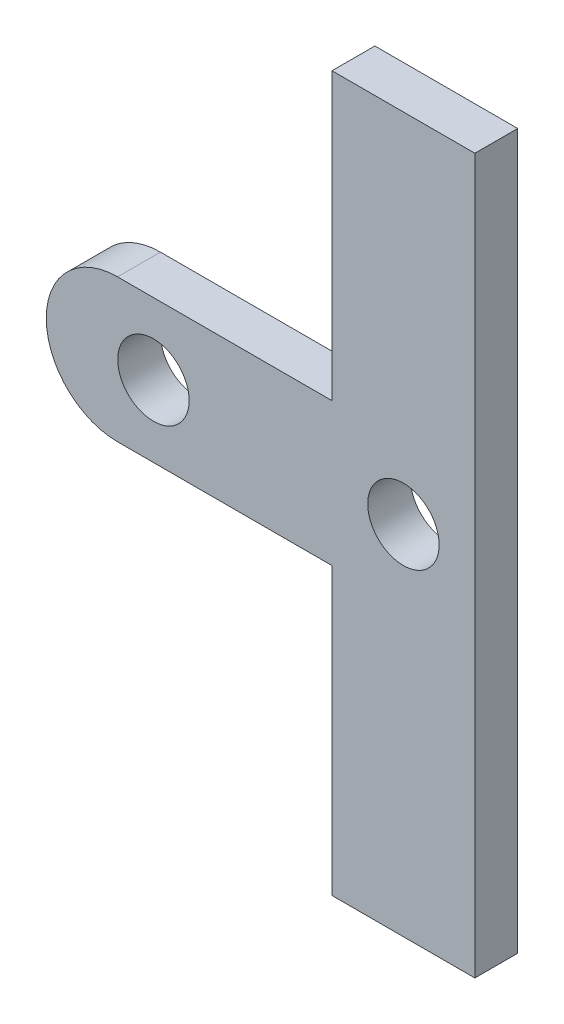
from build123d import *

# Parameters (mm, degrees)
ESQUISSE1_R      = 2.5
EXTRUSION1_DEPTH = 3


with BuildPart() as part:
    # Esquisse1 → Extrusion1 (new body)
    with BuildSketch(Plane.XY):
        with BuildLine():
            Line((-45.349704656, 10), (-30.339704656, 10))
            Line((-30.339704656, 10), (-30.339704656, 30))
            Line((-30.339704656, 30), (-20.339704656, 30))
            Line((-20.339704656, 30), (-20.339704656, -20))
            Line((-20.339704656, -20), (-30.339704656, -20))
            Line((-30.339704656, -20), (-30.339704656, 0))
            Line((-30.339704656, 0), (-45.349704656, 0))
            ThreePointArc((-45.349704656, 0), (-48.878167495, 1.461537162), (-50.339704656, 4.99))
            Line((-50.339704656, 4.99), (-50.339704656, 5.01))
            ThreePointArc((-50.339704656, 5.01), (-48.878167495, 8.538462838), (-45.349704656, 10))
        make_face()
        with Locations((-42.839704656, 5)):
            Circle(ESQUISSE1_R, mode=Mode.SUBTRACT)
        with Locations((-25.339704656, 5)):
            Circle(ESQUISSE1_R, mode=Mode.SUBTRACT)
    extrude(amount=EXTRUSION1_DEPTH)


solid = part.part
